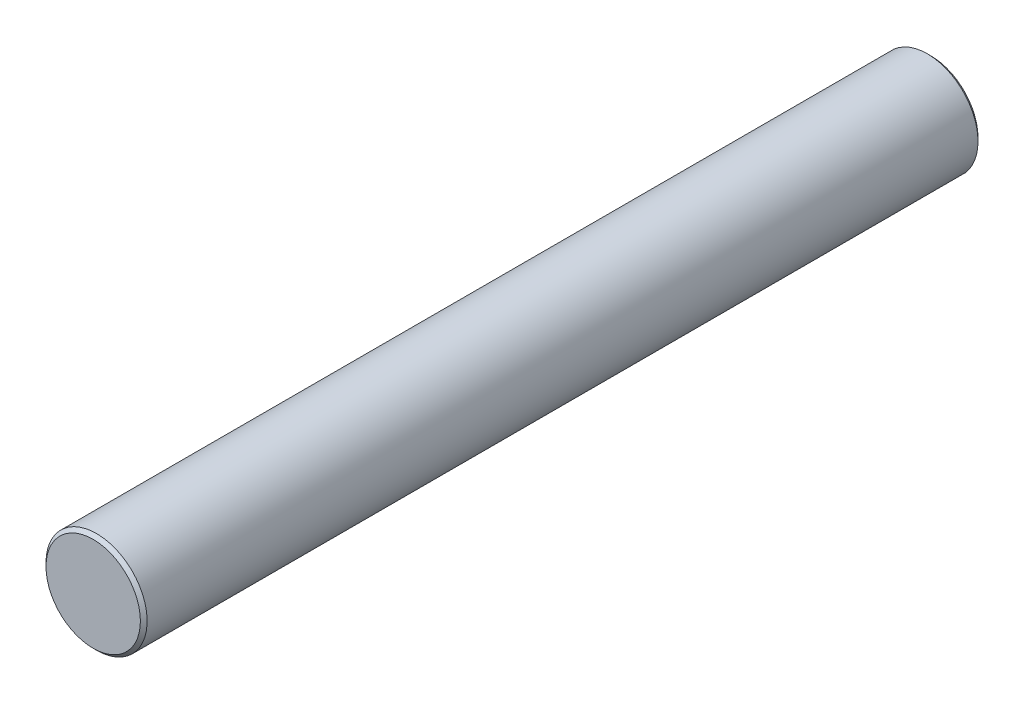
from build123d import *

# Parameters (mm, degrees)
SKETCH_1_R              = 30
EXTRUDE_1_DEPTH         = 497
HOLE_WIZARD_M16_1_D     = 14
HOLE_WIZARD_M16_1_DEPTH = 38
HOLE_WIZARD_M16_1_TIP   = 4.206024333
CHAMFER_1_SIZE          = 2


with BuildPart() as part:
    # Sketch 1 → Extrude 1 (new body)
    with BuildSketch(Plane.XY):
        with Locations(Location((0, 0, 0), (0, 0, 180))):
            Circle(SKETCH_1_R)
    extrude(amount=EXTRUDE_1_DEPTH)

    # Hole Wizard M16 _1
    with Locations(Plane(origin=(0, 0, 0), x_dir=(-1, 0, 0), z_dir=(0, 0, -1))):
        with Locations((0, 0)):
            Hole(HOLE_WIZARD_M16_1_D / 2, depth=HOLE_WIZARD_M16_1_DEPTH)
            with Locations((0, 0, -(HOLE_WIZARD_M16_1_DEPTH + HOLE_WIZARD_M16_1_TIP / 2))):  # 118° drill point
                Cone(0, HOLE_WIZARD_M16_1_D / 2, HOLE_WIZARD_M16_1_TIP, mode=Mode.SUBTRACT)

    # Chamfer 1
    chamfer_1_edges = [part.edges().sort_by_distance(p)[0] for p in [
        (30, 0, 0),
        (30, 0, 497),
    ]]
    chamfer(chamfer_1_edges, length=CHAMFER_1_SIZE)


solid = part.part
